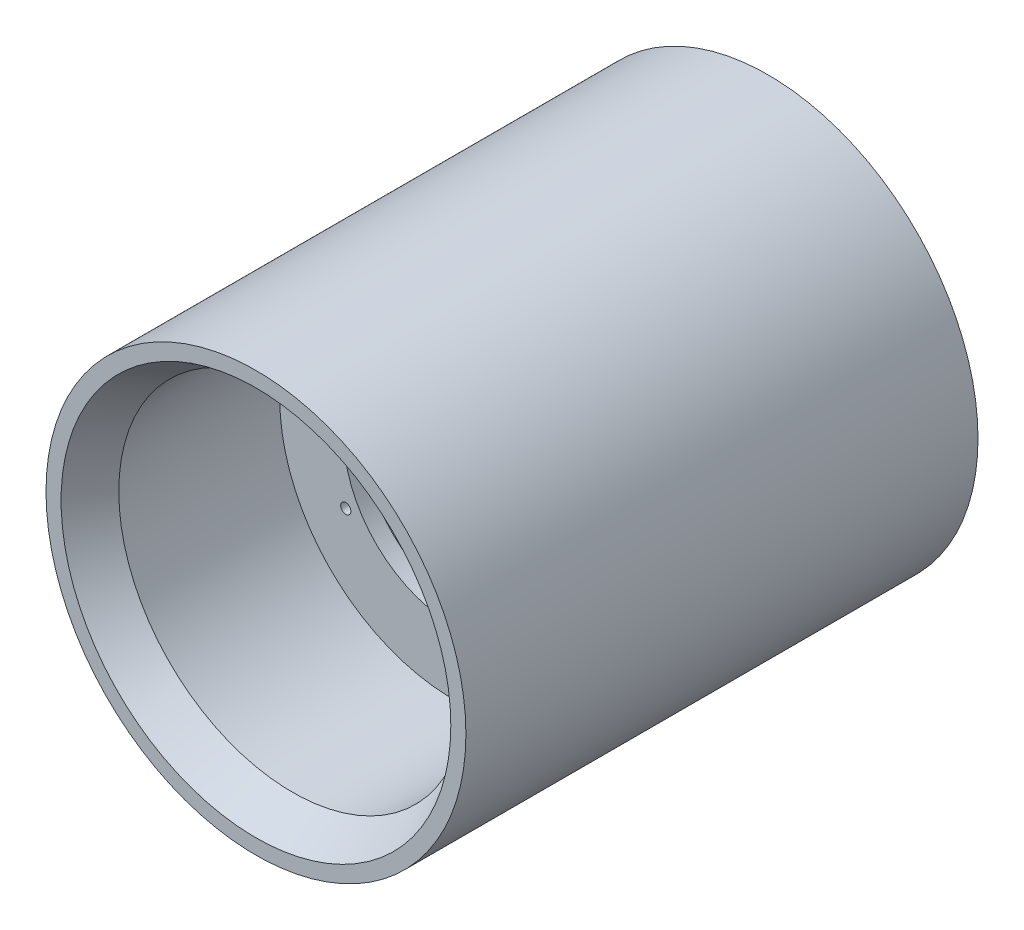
ISO-10303-21;
HEADER;
FILE_DESCRIPTION(('STEP AP214'),'2;1');
FILE_NAME('part.step','',(''),(''),'','','');
FILE_SCHEMA(('AUTOMOTIVE_DESIGN { 1 0 10303 214 1 1 1 1 }'));
ENDSEC;
DATA;
#1=APPLICATION_CONTEXT('core data for automotive mechanical design processes');
#2=APPLICATION_PROTOCOL_DEFINITION('international standard','automotive_design',2000,#1);
#3=PRODUCT_CONTEXT('',#1,'mechanical');
#4=PRODUCT('Part','Part','',(#3));
#5=PRODUCT_RELATED_PRODUCT_CATEGORY('part','',(#4));
#6=PRODUCT_DEFINITION_FORMATION('','',#4);
#7=PRODUCT_DEFINITION_CONTEXT('part definition',#1,'design');
#8=PRODUCT_DEFINITION('design','',#6,#7);
#9=PRODUCT_DEFINITION_SHAPE('','',#8);
#10=(LENGTH_UNIT() NAMED_UNIT(*) SI_UNIT(.MILLI.,.METRE.));
#11=(NAMED_UNIT(*) PLANE_ANGLE_UNIT() SI_UNIT($,.RADIAN.));
#12=(NAMED_UNIT(*) SI_UNIT($,.STERADIAN.) SOLID_ANGLE_UNIT());
#13=UNCERTAINTY_MEASURE_WITH_UNIT(LENGTH_MEASURE(1.E-05),#10,'distance_accuracy_value','');
#14=(GEOMETRIC_REPRESENTATION_CONTEXT(3) GLOBAL_UNCERTAINTY_ASSIGNED_CONTEXT((#13)) GLOBAL_UNIT_ASSIGNED_CONTEXT((#10,
#11,#12)) REPRESENTATION_CONTEXT('',''));
#15=CARTESIAN_POINT('',(0.,0.,0.));
#16=DIRECTION('',(0.,0.,1.));
#17=DIRECTION('',(1.,0.,0.));
#18=AXIS2_PLACEMENT_3D('',#15,#16,#17);
#19=CARTESIAN_POINT('',(0.,0.,88.9));
#20=DIRECTION('',(0.,0.,-1.));
#21=DIRECTION('',(-1.,0.,0.));
#22=AXIS2_PLACEMENT_3D('',#19,#20,#21);
#23=CYLINDRICAL_SURFACE('',#22,36.449);
#24=CARTESIAN_POINT('',(0.,0.,88.9));
#25=DIRECTION('',(0.,0.,1.));
#26=DIRECTION('',(1.,0.,0.));
#27=AXIS2_PLACEMENT_3D('',#24,#25,#26);
#28=CIRCLE('',#27,36.449);
#29=CARTESIAN_POINT('',(36.449,0.,88.9));
#30=VERTEX_POINT('',#29);
#31=EDGE_CURVE('E136',#30,#30,#28,.T.);
#32=ORIENTED_EDGE('',*,*,#31,.F.);
#33=EDGE_LOOP('',(#32));
#34=FACE_BOUND('',#33,.T.);
#35=CARTESIAN_POINT('',(0.,0.,0.));
#36=DIRECTION('',(0.,0.,1.));
#37=DIRECTION('',(1.,0.,0.));
#38=AXIS2_PLACEMENT_3D('',#35,#36,#37);
#39=CIRCLE('',#38,36.449);
#40=CARTESIAN_POINT('',(36.449,0.,0.));
#41=VERTEX_POINT('',#40);
#42=EDGE_CURVE('E135',#41,#41,#39,.T.);
#43=ORIENTED_EDGE('',*,*,#42,.T.);
#44=EDGE_LOOP('',(#43));
#45=FACE_BOUND('',#44,.T.);
#46=ADVANCED_FACE('F39',(#34,#45),#23,.T.);
#47=CARTESIAN_POINT('',(0.,0.,88.9));
#48=DIRECTION('',(0.,0.,1.));
#49=DIRECTION('',(1.,0.,0.));
#50=AXIS2_PLACEMENT_3D('',#47,#48,#49);
#51=PLANE('',#50);
#52=CARTESIAN_POINT('',(0.,0.,88.9));
#53=DIRECTION('',(0.,0.,1.));
#54=DIRECTION('',(1.,0.,0.));
#55=AXIS2_PLACEMENT_3D('',#52,#53,#54);
#56=CIRCLE('',#55,33.8286742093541);
#57=CARTESIAN_POINT('',(33.8286742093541,0.,88.9));
#58=VERTEX_POINT('',#57);
#59=EDGE_CURVE('E11',#58,#58,#56,.F.);
#60=ORIENTED_EDGE('',*,*,#59,.T.);
#61=EDGE_LOOP('',(#60));
#62=FACE_BOUND('',#61,.T.);
#63=ORIENTED_EDGE('',*,*,#31,.T.);
#64=EDGE_LOOP('',(#63));
#65=FACE_BOUND('',#64,.T.);
#66=ADVANCED_FACE('F161',(#62,#65),#51,.T.);
#67=CARTESIAN_POINT('',(0.,0.,0.));
#68=DIRECTION('',(0.,0.,1.));
#69=DIRECTION('',(1.,0.,0.));
#70=AXIS2_PLACEMENT_3D('',#67,#68,#69);
#71=PLANE('',#70);
#72=CARTESIAN_POINT('',(0.,0.,0.));
#73=DIRECTION('',(0.,0.,1.));
#74=DIRECTION('',(1.,0.,0.));
#75=AXIS2_PLACEMENT_3D('',#72,#73,#74);
#76=CIRCLE('',#75,33.8286742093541);
#77=CARTESIAN_POINT('',(33.8286742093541,0.,0.));
#78=VERTEX_POINT('',#77);
#79=EDGE_CURVE('E144',#78,#78,#76,.T.);
#80=ORIENTED_EDGE('',*,*,#79,.T.);
#81=EDGE_LOOP('',(#80));
#82=FACE_BOUND('',#81,.T.);
#83=ORIENTED_EDGE('',*,*,#42,.F.);
#84=EDGE_LOOP('',(#83));
#85=FACE_BOUND('',#84,.T.);
#86=ADVANCED_FACE('F167',(#82,#85),#71,.F.);
#87=CARTESIAN_POINT('',(0.,0.,54.61));
#88=DIRECTION('',(0.,0.,1.));
#89=DIRECTION('',(1.,0.,0.));
#90=AXIS2_PLACEMENT_3D('',#87,#88,#89);
#91=CYLINDRICAL_SURFACE('',#90,30.1625);
#92=CARTESIAN_POINT('',(0.,0.,82.55));
#93=DIRECTION('',(0.,0.,1.));
#94=DIRECTION('',(1.,0.,0.));
#95=AXIS2_PLACEMENT_3D('',#92,#93,#94);
#96=CIRCLE('',#95,30.1625);
#97=CARTESIAN_POINT('',(30.1625,0.,82.55));
#98=VERTEX_POINT('',#97);
#99=EDGE_CURVE('E47',#98,#98,#96,.T.);
#100=ORIENTED_EDGE('',*,*,#99,.T.);
#101=EDGE_LOOP('',(#100));
#102=FACE_BOUND('',#101,.T.);
#103=CARTESIAN_POINT('',(0.,0.,54.61));
#104=DIRECTION('',(0.,0.,1.));
#105=DIRECTION('',(1.,0.,0.));
#106=AXIS2_PLACEMENT_3D('',#103,#104,#105);
#107=CIRCLE('',#106,30.1625);
#108=CARTESIAN_POINT('',(30.1625,0.,54.61));
#109=VERTEX_POINT('',#108);
#110=EDGE_CURVE('E132',#109,#109,#107,.T.);
#111=ORIENTED_EDGE('',*,*,#110,.F.);
#112=EDGE_LOOP('',(#111));
#113=FACE_BOUND('',#112,.T.);
#114=ADVANCED_FACE('F149',(#102,#113),#91,.F.);
#115=CARTESIAN_POINT('',(0.,0.,54.61));
#116=DIRECTION('',(0.,0.,1.));
#117=DIRECTION('',(1.,0.,0.));
#118=AXIS2_PLACEMENT_3D('',#115,#116,#117);
#119=PLANE('',#118);
#120=CARTESIAN_POINT('',(0.,21.59,54.61));
#121=DIRECTION('',(0.,0.,1.));
#122=DIRECTION('',(1.,0.,0.));
#123=AXIS2_PLACEMENT_3D('',#120,#121,#122);
#124=CIRCLE('',#123,0.888999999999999);
#125=CARTESIAN_POINT('',(0.888999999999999,21.59,54.61));
#126=VERTEX_POINT('',#125);
#127=EDGE_CURVE('E93',#126,#126,#124,.T.);
#128=ORIENTED_EDGE('',*,*,#127,.F.);
#129=EDGE_LOOP('',(#128));
#130=FACE_BOUND('',#129,.T.);
#131=CARTESIAN_POINT('',(18.6974884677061,-10.7949999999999,54.61));
#132=DIRECTION('',(0.,0.,1.));
#133=DIRECTION('',(1.,0.,0.));
#134=AXIS2_PLACEMENT_3D('',#131,#132,#133);
#135=CIRCLE('',#134,0.889000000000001);
#136=CARTESIAN_POINT('',(19.5864884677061,-10.7949999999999,54.61));
#137=VERTEX_POINT('',#136);
#138=EDGE_CURVE('E99',#137,#137,#135,.T.);
#139=ORIENTED_EDGE('',*,*,#138,.F.);
#140=EDGE_LOOP('',(#139));
#141=FACE_BOUND('',#140,.T.);
#142=CARTESIAN_POINT('',(-18.6974884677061,-10.795,54.61));
#143=DIRECTION('',(0.,0.,1.));
#144=DIRECTION('',(1.,0.,0.));
#145=AXIS2_PLACEMENT_3D('',#142,#143,#144);
#146=CIRCLE('',#145,0.889000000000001);
#147=CARTESIAN_POINT('',(-17.8084884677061,-10.795,54.61));
#148=VERTEX_POINT('',#147);
#149=EDGE_CURVE('E105',#148,#148,#146,.T.);
#150=ORIENTED_EDGE('',*,*,#149,.F.);
#151=EDGE_LOOP('',(#150));
#152=FACE_BOUND('',#151,.T.);
#153=CARTESIAN_POINT('',(0.,0.,54.61));
#154=DIRECTION('',(0.,0.,1.));
#155=DIRECTION('',(1.,0.,0.));
#156=AXIS2_PLACEMENT_3D('',#153,#154,#155);
#157=CIRCLE('',#156,19.05);
#158=CARTESIAN_POINT('',(19.05,0.,54.61));
#159=VERTEX_POINT('',#158);
#160=EDGE_CURVE('E121',#159,#159,#157,.T.);
#161=ORIENTED_EDGE('',*,*,#160,.F.);
#162=EDGE_LOOP('',(#161));
#163=FACE_BOUND('',#162,.T.);
#164=ORIENTED_EDGE('',*,*,#110,.T.);
#165=EDGE_LOOP('',(#164));
#166=FACE_BOUND('',#165,.T.);
#167=ADVANCED_FACE('F178',(#130,#141,#152,#163,#166),#119,.T.);
#168=CARTESIAN_POINT('',(0.,0.,35.052));
#169=DIRECTION('',(0.,0.,-1.));
#170=DIRECTION('',(-1.,0.,0.));
#171=AXIS2_PLACEMENT_3D('',#168,#169,#170);
#172=CYLINDRICAL_SURFACE('',#171,30.1625);
#173=CARTESIAN_POINT('',(0.,0.,6.35000000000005));
#174=DIRECTION('',(0.,0.,1.));
#175=DIRECTION('',(1.,0.,0.));
#176=AXIS2_PLACEMENT_3D('',#173,#174,#175);
#177=CIRCLE('',#176,30.1625);
#178=CARTESIAN_POINT('',(30.1625,0.,6.35000000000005));
#179=VERTEX_POINT('',#178);
#180=EDGE_CURVE('E139',#179,#179,#177,.F.);
#181=ORIENTED_EDGE('',*,*,#180,.T.);
#182=EDGE_LOOP('',(#181));
#183=FACE_BOUND('',#182,.T.);
#184=CARTESIAN_POINT('',(0.,0.,35.052));
#185=DIRECTION('',(0.,0.,-1.));
#186=DIRECTION('',(-1.,0.,0.));
#187=AXIS2_PLACEMENT_3D('',#184,#185,#186);
#188=CIRCLE('',#187,30.1625);
#189=CARTESIAN_POINT('',(-30.1625,0.,35.052));
#190=VERTEX_POINT('',#189);
#191=EDGE_CURVE('E127',#190,#190,#188,.T.);
#192=ORIENTED_EDGE('',*,*,#191,.F.);
#193=EDGE_LOOP('',(#192));
#194=FACE_BOUND('',#193,.T.);
#195=ADVANCED_FACE('F181',(#183,#194),#172,.F.);
#196=CARTESIAN_POINT('',(0.,0.,35.052));
#197=DIRECTION('',(0.,0.,-1.));
#198=DIRECTION('',(-1.,0.,0.));
#199=AXIS2_PLACEMENT_3D('',#196,#197,#198);
#200=PLANE('',#199);
#201=CARTESIAN_POINT('',(0.,21.59,35.052));
#202=DIRECTION('',(0.,0.,-1.));
#203=DIRECTION('',(-1.,0.,0.));
#204=AXIS2_PLACEMENT_3D('',#201,#202,#203);
#205=CIRCLE('',#204,0.888999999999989);
#206=CARTESIAN_POINT('',(-0.888999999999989,21.59,35.052));
#207=VERTEX_POINT('',#206);
#208=EDGE_CURVE('E77',#207,#207,#205,.T.);
#209=ORIENTED_EDGE('',*,*,#208,.F.);
#210=EDGE_LOOP('',(#209));
#211=FACE_BOUND('',#210,.T.);
#212=CARTESIAN_POINT('',(-18.6974884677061,-10.7949999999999,35.052));
#213=DIRECTION('',(0.,0.,-1.));
#214=DIRECTION('',(-1.,0.,0.));
#215=AXIS2_PLACEMENT_3D('',#212,#213,#214);
#216=CIRCLE('',#215,0.888999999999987);
#217=CARTESIAN_POINT('',(-19.586488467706,-10.7949999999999,35.052));
#218=VERTEX_POINT('',#217);
#219=EDGE_CURVE('E76',#218,#218,#216,.T.);
#220=ORIENTED_EDGE('',*,*,#219,.F.);
#221=EDGE_LOOP('',(#220));
#222=FACE_BOUND('',#221,.T.);
#223=CARTESIAN_POINT('',(18.6974884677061,-10.795,35.052));
#224=DIRECTION('',(0.,0.,-1.));
#225=DIRECTION('',(-1.,0.,0.));
#226=AXIS2_PLACEMENT_3D('',#223,#224,#225);
#227=CIRCLE('',#226,0.888999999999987);
#228=CARTESIAN_POINT('',(17.8084884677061,-10.795,35.052));
#229=VERTEX_POINT('',#228);
#230=EDGE_CURVE('E87',#229,#229,#227,.T.);
#231=ORIENTED_EDGE('',*,*,#230,.F.);
#232=EDGE_LOOP('',(#231));
#233=FACE_BOUND('',#232,.T.);
#234=CARTESIAN_POINT('',(0.,0.,35.052));
#235=DIRECTION('',(0.,0.,-1.));
#236=DIRECTION('',(-1.,0.,0.));
#237=AXIS2_PLACEMENT_3D('',#234,#235,#236);
#238=CIRCLE('',#237,19.05);
#239=CARTESIAN_POINT('',(-19.05,0.,35.052));
#240=VERTEX_POINT('',#239);
#241=EDGE_CURVE('E115',#240,#240,#238,.T.);
#242=ORIENTED_EDGE('',*,*,#241,.F.);
#243=EDGE_LOOP('',(#242));
#244=FACE_BOUND('',#243,.T.);
#245=ORIENTED_EDGE('',*,*,#191,.T.);
#246=EDGE_LOOP('',(#245));
#247=FACE_BOUND('',#246,.T.);
#248=ADVANCED_FACE('F185',(#211,#222,#233,#244,#247),#200,.T.);
#249=CARTESIAN_POINT('',(0.,0.,51.689));
#250=DIRECTION('',(0.,0.,1.));
#251=DIRECTION('',(1.,0.,0.));
#252=AXIS2_PLACEMENT_3D('',#249,#250,#251);
#253=CYLINDRICAL_SURFACE('',#252,19.05);
#254=CARTESIAN_POINT('',(0.,0.,51.689));
#255=DIRECTION('',(0.,0.,1.));
#256=DIRECTION('',(1.,0.,0.));
#257=AXIS2_PLACEMENT_3D('',#254,#255,#256);
#258=CIRCLE('',#257,19.05);
#259=CARTESIAN_POINT('',(19.05,0.,51.689));
#260=VERTEX_POINT('',#259);
#261=EDGE_CURVE('E124',#260,#260,#258,.T.);
#262=ORIENTED_EDGE('',*,*,#261,.F.);
#263=EDGE_LOOP('',(#262));
#264=FACE_BOUND('',#263,.T.);
#265=ORIENTED_EDGE('',*,*,#160,.T.);
#266=EDGE_LOOP('',(#265));
#267=FACE_BOUND('',#266,.T.);
#268=ADVANCED_FACE('F189',(#264,#267),#253,.F.);
#269=CARTESIAN_POINT('',(0.,0.,51.689));
#270=DIRECTION('',(0.,0.,1.));
#271=DIRECTION('',(1.,0.,0.));
#272=AXIS2_PLACEMENT_3D('',#269,#270,#271);
#273=PLANE('',#272);
#274=CARTESIAN_POINT('',(0.,0.,51.689));
#275=DIRECTION('',(0.,0.,1.));
#276=DIRECTION('',(1.,0.,0.));
#277=AXIS2_PLACEMENT_3D('',#274,#275,#276);
#278=CIRCLE('',#277,15.7861);
#279=CARTESIAN_POINT('',(15.7861,0.,51.689));
#280=VERTEX_POINT('',#279);
#281=EDGE_CURVE('E112',#280,#280,#278,.T.);
#282=ORIENTED_EDGE('',*,*,#281,.F.);
#283=EDGE_LOOP('',(#282));
#284=FACE_BOUND('',#283,.T.);
#285=ORIENTED_EDGE('',*,*,#261,.T.);
#286=EDGE_LOOP('',(#285));
#287=FACE_BOUND('',#286,.T.);
#288=ADVANCED_FACE('F193',(#284,#287),#273,.T.);
#289=CARTESIAN_POINT('',(0.,0.,38.862));
#290=DIRECTION('',(0.,0.,-1.));
#291=DIRECTION('',(-1.,0.,0.));
#292=AXIS2_PLACEMENT_3D('',#289,#290,#291);
#293=CYLINDRICAL_SURFACE('',#292,19.05);
#294=CARTESIAN_POINT('',(0.,0.,38.862));
#295=DIRECTION('',(0.,0.,-1.));
#296=DIRECTION('',(-1.,0.,0.));
#297=AXIS2_PLACEMENT_3D('',#294,#295,#296);
#298=CIRCLE('',#297,19.05);
#299=CARTESIAN_POINT('',(-19.05,0.,38.862));
#300=VERTEX_POINT('',#299);
#301=EDGE_CURVE('E118',#300,#300,#298,.T.);
#302=CARTESIAN_POINT('',(-19.05,0.,38.862));
#303=CARTESIAN_POINT('',(-19.05,0.,38.8223125));
#304=CARTESIAN_POINT('',(-19.05,0.,38.782625));
#305=CARTESIAN_POINT('',(-19.05,0.,38.70325));
#306=CARTESIAN_POINT('',(-19.05,0.,38.6635625));
#307=CARTESIAN_POINT('',(-19.05,0.,38.5841875));
#308=CARTESIAN_POINT('',(-19.05,0.,38.5445));
#309=CARTESIAN_POINT('',(-19.05,0.,38.465125));
#310=CARTESIAN_POINT('',(-19.05,0.,38.4254375));
#311=CARTESIAN_POINT('',(-19.05,0.,38.3460625));
#312=CARTESIAN_POINT('',(-19.05,0.,38.306375));
#313=CARTESIAN_POINT('',(-19.05,0.,38.227));
#314=CARTESIAN_POINT('',(-19.05,0.,38.1873125));
#315=CARTESIAN_POINT('',(-19.05,0.,38.1079375));
#316=CARTESIAN_POINT('',(-19.05,0.,38.06825));
#317=CARTESIAN_POINT('',(-19.05,0.,37.988875));
#318=CARTESIAN_POINT('',(-19.05,0.,37.9491875));
#319=CARTESIAN_POINT('',(-19.05,0.,37.8698125));
#320=CARTESIAN_POINT('',(-19.05,0.,37.830125));
#321=CARTESIAN_POINT('',(-19.05,0.,37.75075));
#322=CARTESIAN_POINT('',(-19.05,0.,37.7110625));
#323=CARTESIAN_POINT('',(-19.05,0.,37.6316875));
#324=CARTESIAN_POINT('',(-19.05,0.,37.592));
#325=CARTESIAN_POINT('',(-19.05,0.,37.512625));
#326=CARTESIAN_POINT('',(-19.05,0.,37.4729375));
#327=CARTESIAN_POINT('',(-19.05,0.,37.3935625));
#328=CARTESIAN_POINT('',(-19.05,0.,37.353875));
#329=CARTESIAN_POINT('',(-19.05,0.,37.2745));
#330=CARTESIAN_POINT('',(-19.05,0.,37.2348125));
#331=CARTESIAN_POINT('',(-19.05,0.,37.1554375));
#332=CARTESIAN_POINT('',(-19.05,0.,37.11575));
#333=CARTESIAN_POINT('',(-19.05,0.,37.036375));
#334=CARTESIAN_POINT('',(-19.05,0.,36.9966875));
#335=CARTESIAN_POINT('',(-19.05,0.,36.9173125));
#336=CARTESIAN_POINT('',(-19.05,0.,36.877625));
#337=CARTESIAN_POINT('',(-19.05,0.,36.79825));
#338=CARTESIAN_POINT('',(-19.05,0.,36.7585625));
#339=CARTESIAN_POINT('',(-19.05,0.,36.6791875));
#340=CARTESIAN_POINT('',(-19.05,0.,36.6395));
#341=CARTESIAN_POINT('',(-19.05,0.,36.560125));
#342=CARTESIAN_POINT('',(-19.05,0.,36.5204375));
#343=CARTESIAN_POINT('',(-19.05,0.,36.4410625));
#344=CARTESIAN_POINT('',(-19.05,0.,36.401375));
#345=CARTESIAN_POINT('',(-19.05,0.,36.322));
#346=CARTESIAN_POINT('',(-19.05,0.,36.2823125));
#347=CARTESIAN_POINT('',(-19.05,0.,36.2029375));
#348=CARTESIAN_POINT('',(-19.05,0.,36.16325));
#349=CARTESIAN_POINT('',(-19.05,0.,36.083875));
#350=CARTESIAN_POINT('',(-19.05,0.,36.0441875));
#351=CARTESIAN_POINT('',(-19.05,0.,35.9648125));
#352=CARTESIAN_POINT('',(-19.05,0.,35.925125));
#353=CARTESIAN_POINT('',(-19.05,0.,35.84575));
#354=CARTESIAN_POINT('',(-19.05,0.,35.8060625));
#355=CARTESIAN_POINT('',(-19.05,0.,35.7266875));
#356=CARTESIAN_POINT('',(-19.05,0.,35.687));
#357=CARTESIAN_POINT('',(-19.05,0.,35.607625));
#358=CARTESIAN_POINT('',(-19.05,0.,35.5679375));
#359=CARTESIAN_POINT('',(-19.05,0.,35.4885625));
#360=CARTESIAN_POINT('',(-19.05,0.,35.448875));
#361=CARTESIAN_POINT('',(-19.05,0.,35.3695));
#362=CARTESIAN_POINT('',(-19.05,0.,35.3298125));
#363=CARTESIAN_POINT('',(-19.05,0.,35.2504375));
#364=CARTESIAN_POINT('',(-19.05,0.,35.21075));
#365=CARTESIAN_POINT('',(-19.05,0.,35.131375));
#366=CARTESIAN_POINT('',(-19.05,0.,35.0916875));
#367=CARTESIAN_POINT('',(-19.05,0.,35.052));
#368=B_SPLINE_CURVE_WITH_KNOTS('',3,(#302,#303,#304,#305,#306,#307,#308,#309,#310,#311,#312,
#313,#314,#315,#316,#317,#318,#319,#320,#321,#322,#323,#324,#325,#326,#327,#328,#329,#330,#331,
#332,#333,#334,#335,#336,#337,#338,#339,#340,#341,#342,#343,#344,#345,#346,#347,#348,#349,#350,
#351,#352,#353,#354,#355,#356,#357,#358,#359,#360,#361,#362,#363,#364,#365,#366,#367),
.UNSPECIFIED.,.F.,.F.,(4,2,2,2,2,2,2,2,2,2,2,2,2,2,2,2,2,2,2,2,2,2,2,2,2,2,2,2,2,2,2,2,4),(0.,
0.119062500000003,0.238125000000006,0.357187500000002,0.476250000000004,0.5953125,
0.714375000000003,0.833437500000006,0.952500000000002,1.0715625,1.190625,1.3096875,
1.42875000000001,1.5478125,1.66687500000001,1.7859375,1.905,2.02406250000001,2.143125,
2.26218750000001,2.38125,2.5003125,2.61937500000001,2.7384375,2.85750000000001,2.9765625,
3.095625,3.21468750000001,3.33375,3.45281250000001,3.571875,3.6909375,3.81000000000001),.UNSPECIFIED.);
#369=EDGE_CURVE('BSEAM197',#300,#240,#368,.T.);
#370=ORIENTED_EDGE('',*,*,#301,.F.);
#371=ORIENTED_EDGE('',*,*,#241,.T.);
#372=ORIENTED_EDGE('',*,*,#369,.T.);
#373=ORIENTED_EDGE('',*,*,#369,.F.);
#374=EDGE_LOOP('',(#370,#372,#371,#373));
#375=FACE_BOUND('',#374,.T.);
#376=ADVANCED_FACE('F197',(#375),#293,.F.);
#377=CARTESIAN_POINT('',(0.,0.,38.862));
#378=DIRECTION('',(0.,0.,-1.));
#379=DIRECTION('',(-1.,0.,0.));
#380=AXIS2_PLACEMENT_3D('',#377,#378,#379);
#381=PLANE('',#380);
#382=CARTESIAN_POINT('',(0.,0.,38.862));
#383=DIRECTION('',(0.,0.,-1.));
#384=DIRECTION('',(-1.,0.,0.));
#385=AXIS2_PLACEMENT_3D('',#382,#383,#384);
#386=CIRCLE('',#385,15.7861);
#387=CARTESIAN_POINT('',(-15.7861,0.,38.862));
#388=VERTEX_POINT('',#387);
#389=EDGE_CURVE('E111',#388,#388,#386,.F.);
#390=ORIENTED_EDGE('',*,*,#389,.T.);
#391=EDGE_LOOP('',(#390));
#392=FACE_BOUND('',#391,.T.);
#393=ORIENTED_EDGE('',*,*,#301,.T.);
#394=EDGE_LOOP('',(#393));
#395=FACE_BOUND('',#394,.T.);
#396=ADVANCED_FACE('F201',(#392,#395),#381,.T.);
#397=CARTESIAN_POINT('',(0.,0.,-0.001000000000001));
#398=DIRECTION('',(0.,0.,1.));
#399=DIRECTION('',(1.,0.,0.));
#400=AXIS2_PLACEMENT_3D('',#397,#398,#399);
#401=CYLINDRICAL_SURFACE('',#400,15.7861);
#402=ORIENTED_EDGE('',*,*,#389,.F.);
#403=EDGE_LOOP('',(#402));
#404=FACE_BOUND('',#403,.T.);
#405=ORIENTED_EDGE('',*,*,#281,.T.);
#406=EDGE_LOOP('',(#405));
#407=FACE_BOUND('',#406,.T.);
#408=ADVANCED_FACE('F205',(#404,#407),#401,.F.);
#409=CARTESIAN_POINT('',(-18.6974884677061,-10.795,48.8696));
#410=DIRECTION('',(0.,0.,1.));
#411=DIRECTION('',(1.,0.,0.));
#412=AXIS2_PLACEMENT_3D('',#409,#410,#411);
#413=CONICAL_SURFACE('',#412,0.888999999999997,1.02974425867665);
#414=CARTESIAN_POINT('',(-18.6974884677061,-10.795,48.3354349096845));
#415=VERTEX_POINT('',#414);
#416=VERTEX_LOOP('',#415);
#417=FACE_BOUND('',#416,.T.);
#418=CARTESIAN_POINT('',(-18.6974884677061,-10.795,48.8696));
#419=DIRECTION('',(0.,0.,1.));
#420=DIRECTION('',(1.,0.,0.));
#421=AXIS2_PLACEMENT_3D('',#418,#419,#420);
#422=CIRCLE('',#421,0.888999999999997);
#423=CARTESIAN_POINT('',(-17.8084884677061,-10.795,48.8696));
#424=VERTEX_POINT('',#423);
#425=EDGE_CURVE('E108',#424,#424,#422,.T.);
#426=ORIENTED_EDGE('',*,*,#425,.T.);
#427=EDGE_LOOP('',(#426));
#428=FACE_BOUND('',#427,.T.);
#429=ADVANCED_FACE('F209',(#417,#428),#413,.F.);
#430=CARTESIAN_POINT('',(-18.6974884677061,-10.795,54.61));
#431=DIRECTION('',(0.,0.,1.));
#432=DIRECTION('',(1.,0.,0.));
#433=AXIS2_PLACEMENT_3D('',#430,#431,#432);
#434=CYLINDRICAL_SURFACE('',#433,0.888999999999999);
#435=ORIENTED_EDGE('',*,*,#425,.F.);
#436=EDGE_LOOP('',(#435));
#437=FACE_BOUND('',#436,.T.);
#438=ORIENTED_EDGE('',*,*,#149,.T.);
#439=EDGE_LOOP('',(#438));
#440=FACE_BOUND('',#439,.T.);
#441=ADVANCED_FACE('F213',(#437,#440),#434,.F.);
#442=CARTESIAN_POINT('',(18.6974884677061,-10.7949999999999,48.8696));
#443=DIRECTION('',(0.,0.,1.));
#444=DIRECTION('',(1.,0.,0.));
#445=AXIS2_PLACEMENT_3D('',#442,#443,#444);
#446=CONICAL_SURFACE('',#445,0.888999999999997,1.02974425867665);
#447=CARTESIAN_POINT('',(18.6974884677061,-10.7949999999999,48.3354349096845));
#448=VERTEX_POINT('',#447);
#449=VERTEX_LOOP('',#448);
#450=FACE_BOUND('',#449,.T.);
#451=CARTESIAN_POINT('',(18.6974884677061,-10.7949999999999,48.8696));
#452=DIRECTION('',(0.,0.,1.));
#453=DIRECTION('',(1.,0.,0.));
#454=AXIS2_PLACEMENT_3D('',#451,#452,#453);
#455=CIRCLE('',#454,0.888999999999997);
#456=CARTESIAN_POINT('',(19.5864884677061,-10.7949999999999,48.8696));
#457=VERTEX_POINT('',#456);
#458=EDGE_CURVE('E102',#457,#457,#455,.T.);
#459=ORIENTED_EDGE('',*,*,#458,.T.);
#460=EDGE_LOOP('',(#459));
#461=FACE_BOUND('',#460,.T.);
#462=ADVANCED_FACE('F216',(#450,#461),#446,.F.);
#463=CARTESIAN_POINT('',(18.6974884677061,-10.7949999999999,54.61));
#464=DIRECTION('',(0.,0.,1.));
#465=DIRECTION('',(1.,0.,0.));
#466=AXIS2_PLACEMENT_3D('',#463,#464,#465);
#467=CYLINDRICAL_SURFACE('',#466,0.888999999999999);
#468=ORIENTED_EDGE('',*,*,#458,.F.);
#469=EDGE_LOOP('',(#468));
#470=FACE_BOUND('',#469,.T.);
#471=ORIENTED_EDGE('',*,*,#138,.T.);
#472=EDGE_LOOP('',(#471));
#473=FACE_BOUND('',#472,.T.);
#474=ADVANCED_FACE('F220',(#470,#473),#467,.F.);
#475=CARTESIAN_POINT('',(0.,21.59,48.8696));
#476=DIRECTION('',(0.,0.,1.));
#477=DIRECTION('',(1.,0.,0.));
#478=AXIS2_PLACEMENT_3D('',#475,#476,#477);
#479=CONICAL_SURFACE('',#478,0.888999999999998,1.02974425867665);
#480=CARTESIAN_POINT('',(0.,21.59,48.3354349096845));
#481=VERTEX_POINT('',#480);
#482=VERTEX_LOOP('',#481);
#483=FACE_BOUND('',#482,.T.);
#484=CARTESIAN_POINT('',(0.,21.59,48.8696));
#485=DIRECTION('',(0.,0.,1.));
#486=DIRECTION('',(1.,0.,0.));
#487=AXIS2_PLACEMENT_3D('',#484,#485,#486);
#488=CIRCLE('',#487,0.888999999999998);
#489=CARTESIAN_POINT('',(0.888999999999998,21.59,48.8696));
#490=VERTEX_POINT('',#489);
#491=EDGE_CURVE('E96',#490,#490,#488,.T.);
#492=ORIENTED_EDGE('',*,*,#491,.T.);
#493=EDGE_LOOP('',(#492));
#494=FACE_BOUND('',#493,.T.);
#495=ADVANCED_FACE('F223',(#483,#494),#479,.F.);
#496=CARTESIAN_POINT('',(0.,21.59,54.61));
#497=DIRECTION('',(0.,0.,1.));
#498=DIRECTION('',(1.,0.,0.));
#499=AXIS2_PLACEMENT_3D('',#496,#497,#498);
#500=CYLINDRICAL_SURFACE('',#499,0.888999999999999);
#501=ORIENTED_EDGE('',*,*,#491,.F.);
#502=EDGE_LOOP('',(#501));
#503=FACE_BOUND('',#502,.T.);
#504=ORIENTED_EDGE('',*,*,#127,.T.);
#505=EDGE_LOOP('',(#504));
#506=FACE_BOUND('',#505,.T.);
#507=ADVANCED_FACE('F227',(#503,#506),#500,.F.);
#508=CARTESIAN_POINT('',(18.6974884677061,-10.795,40.7924));
#509=DIRECTION('',(0.,0.,-1.));
#510=DIRECTION('',(-1.,0.,0.));
#511=AXIS2_PLACEMENT_3D('',#508,#509,#510);
#512=CONICAL_SURFACE('',#511,0.888999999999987,1.02974425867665);
#513=CARTESIAN_POINT('',(18.6974884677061,-10.795,41.3265650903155));
#514=VERTEX_POINT('',#513);
#515=VERTEX_LOOP('',#514);
#516=FACE_BOUND('',#515,.T.);
#517=CARTESIAN_POINT('',(18.6974884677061,-10.795,40.7924));
#518=DIRECTION('',(0.,0.,-1.));
#519=DIRECTION('',(-1.,0.,0.));
#520=AXIS2_PLACEMENT_3D('',#517,#518,#519);
#521=CIRCLE('',#520,0.888999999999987);
#522=CARTESIAN_POINT('',(17.8084884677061,-10.795,40.7924));
#523=VERTEX_POINT('',#522);
#524=EDGE_CURVE('E90',#523,#523,#521,.T.);
#525=ORIENTED_EDGE('',*,*,#524,.T.);
#526=EDGE_LOOP('',(#525));
#527=FACE_BOUND('',#526,.T.);
#528=ADVANCED_FACE('F231',(#516,#527),#512,.F.);
#529=CARTESIAN_POINT('',(18.6974884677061,-10.795,35.052));
#530=DIRECTION('',(0.,0.,-1.));
#531=DIRECTION('',(-1.,0.,0.));
#532=AXIS2_PLACEMENT_3D('',#529,#530,#531);
#533=CYLINDRICAL_SURFACE('',#532,0.888999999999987);
#534=ORIENTED_EDGE('',*,*,#524,.F.);
#535=EDGE_LOOP('',(#534));
#536=FACE_BOUND('',#535,.T.);
#537=ORIENTED_EDGE('',*,*,#230,.T.);
#538=EDGE_LOOP('',(#537));
#539=FACE_BOUND('',#538,.T.);
#540=ADVANCED_FACE('F235',(#536,#539),#533,.F.);
#541=CARTESIAN_POINT('',(-18.6974884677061,-10.7949999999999,40.7924));
#542=DIRECTION('',(0.,0.,-1.));
#543=DIRECTION('',(-1.,0.,0.));
#544=AXIS2_PLACEMENT_3D('',#541,#542,#543);
#545=CONICAL_SURFACE('',#544,0.888999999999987,1.02974425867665);
#546=CARTESIAN_POINT('',(-18.6974884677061,-10.7949999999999,41.3265650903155));
#547=VERTEX_POINT('',#546);
#548=VERTEX_LOOP('',#547);
#549=FACE_BOUND('',#548,.T.);
#550=CARTESIAN_POINT('',(-18.6974884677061,-10.7949999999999,40.7924));
#551=DIRECTION('',(0.,0.,-1.));
#552=DIRECTION('',(-1.,0.,0.));
#553=AXIS2_PLACEMENT_3D('',#550,#551,#552);
#554=CIRCLE('',#553,0.888999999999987);
#555=CARTESIAN_POINT('',(-19.586488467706,-10.7949999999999,40.7924));
#556=VERTEX_POINT('',#555);
#557=EDGE_CURVE('E80',#556,#556,#554,.T.);
#558=ORIENTED_EDGE('',*,*,#557,.T.);
#559=EDGE_LOOP('',(#558));
#560=FACE_BOUND('',#559,.T.);
#561=ADVANCED_FACE('F239',(#549,#560),#545,.F.);
#562=CARTESIAN_POINT('',(-18.6974884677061,-10.7949999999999,35.052));
#563=DIRECTION('',(0.,0.,-1.));
#564=DIRECTION('',(-1.,0.,0.));
#565=AXIS2_PLACEMENT_3D('',#562,#563,#564);
#566=CYLINDRICAL_SURFACE('',#565,0.888999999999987);
#567=ORIENTED_EDGE('',*,*,#557,.F.);
#568=EDGE_LOOP('',(#567));
#569=FACE_BOUND('',#568,.T.);
#570=ORIENTED_EDGE('',*,*,#219,.T.);
#571=EDGE_LOOP('',(#570));
#572=FACE_BOUND('',#571,.T.);
#573=ADVANCED_FACE('F70',(#569,#572),#566,.F.);
#574=CARTESIAN_POINT('',(0.,21.59,40.7924));
#575=DIRECTION('',(0.,0.,-1.));
#576=DIRECTION('',(-1.,0.,0.));
#577=AXIS2_PLACEMENT_3D('',#574,#575,#576);
#578=CONICAL_SURFACE('',#577,0.888999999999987,1.02974425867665);
#579=CARTESIAN_POINT('',(0.,21.59,41.3265650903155));
#580=VERTEX_POINT('',#579);
#581=VERTEX_LOOP('',#580);
#582=FACE_BOUND('',#581,.T.);
#583=CARTESIAN_POINT('',(0.,21.59,40.7924));
#584=DIRECTION('',(0.,0.,-1.));
#585=DIRECTION('',(-1.,0.,0.));
#586=AXIS2_PLACEMENT_3D('',#583,#584,#585);
#587=CIRCLE('',#586,0.888999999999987);
#588=CARTESIAN_POINT('',(-0.888999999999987,21.59,40.7924));
#589=VERTEX_POINT('',#588);
#590=EDGE_CURVE('E74',#589,#589,#587,.T.);
#591=ORIENTED_EDGE('',*,*,#590,.T.);
#592=EDGE_LOOP('',(#591));
#593=FACE_BOUND('',#592,.T.);
#594=ADVANCED_FACE('F66',(#582,#593),#578,.F.);
#595=CARTESIAN_POINT('',(0.,21.59,35.052));
#596=DIRECTION('',(0.,0.,-1.));
#597=DIRECTION('',(-1.,0.,0.));
#598=AXIS2_PLACEMENT_3D('',#595,#596,#597);
#599=CYLINDRICAL_SURFACE('',#598,0.888999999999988);
#600=ORIENTED_EDGE('',*,*,#590,.F.);
#601=EDGE_LOOP('',(#600));
#602=FACE_BOUND('',#601,.T.);
#603=ORIENTED_EDGE('',*,*,#208,.T.);
#604=EDGE_LOOP('',(#603));
#605=FACE_BOUND('',#604,.T.);
#606=ADVANCED_FACE('F69',(#602,#605),#599,.F.);
#607=CARTESIAN_POINT('',(0.,0.,6.35000000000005));
#608=DIRECTION('',(0.,0.,-1.));
#609=DIRECTION('',(-1.,0.,0.));
#610=AXIS2_PLACEMENT_3D('',#607,#608,#609);
#611=CONICAL_SURFACE('',#610,30.1625,0.523598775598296);
#612=ORIENTED_EDGE('',*,*,#79,.F.);
#613=EDGE_LOOP('',(#612));
#614=FACE_BOUND('',#613,.T.);
#615=ORIENTED_EDGE('',*,*,#180,.F.);
#616=EDGE_LOOP('',(#615));
#617=FACE_BOUND('',#616,.T.);
#618=ADVANCED_FACE('F153',(#614,#617),#611,.F.);
#619=CARTESIAN_POINT('',(0.,0.,82.55));
#620=DIRECTION('',(0.,0.,1.));
#621=DIRECTION('',(1.,0.,0.));
#622=AXIS2_PLACEMENT_3D('',#619,#620,#621);
#623=CONICAL_SURFACE('',#622,30.1625,0.523598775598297);
#624=ORIENTED_EDGE('',*,*,#59,.F.);
#625=EDGE_LOOP('',(#624));
#626=FACE_BOUND('',#625,.T.);
#627=ORIENTED_EDGE('',*,*,#99,.F.);
#628=EDGE_LOOP('',(#627));
#629=FACE_BOUND('',#628,.T.);
#630=ADVANCED_FACE('F41',(#626,#629),#623,.F.);
#631=CLOSED_SHELL('',(#46,#66,#86,#114,#167,#195,#248,#268,#288,#376,#396,#408,#429,#441,#462,
#474,#495,#507,#528,#540,#561,#573,#594,#606,#618,#630));
#632=MANIFOLD_SOLID_BREP('B2',#631);
#633=ADVANCED_BREP_SHAPE_REPRESENTATION('',(#18,#632),#14);
#634=SHAPE_DEFINITION_REPRESENTATION(#9,#633);
ENDSEC;
END-ISO-10303-21;
